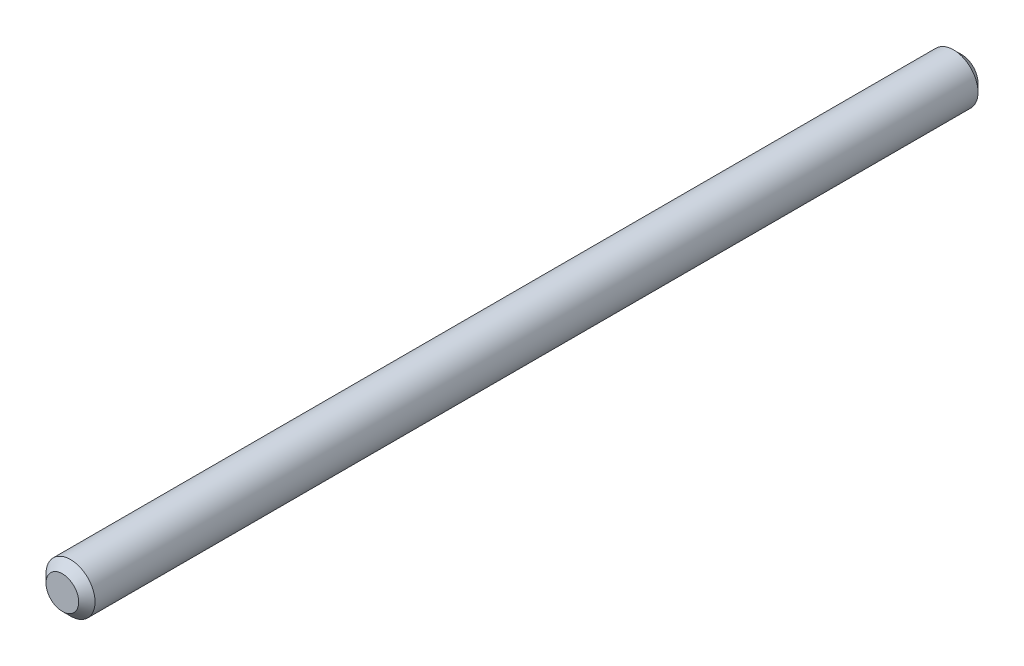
ISO-10303-21;
HEADER;
FILE_DESCRIPTION(('STEP AP214'),'2;1');
FILE_NAME('part.step','',(''),(''),'','','');
FILE_SCHEMA(('AUTOMOTIVE_DESIGN { 1 0 10303 214 1 1 1 1 }'));
ENDSEC;
DATA;
#1=APPLICATION_CONTEXT('core data for automotive mechanical design processes');
#2=APPLICATION_PROTOCOL_DEFINITION('international standard','automotive_design',2000,#1);
#3=PRODUCT_CONTEXT('',#1,'mechanical');
#4=PRODUCT('Part','Part','',(#3));
#5=PRODUCT_RELATED_PRODUCT_CATEGORY('part','',(#4));
#6=PRODUCT_DEFINITION_FORMATION('','',#4);
#7=PRODUCT_DEFINITION_CONTEXT('part definition',#1,'design');
#8=PRODUCT_DEFINITION('design','',#6,#7);
#9=PRODUCT_DEFINITION_SHAPE('','',#8);
#10=(LENGTH_UNIT() NAMED_UNIT(*) SI_UNIT(.MILLI.,.METRE.));
#11=(NAMED_UNIT(*) PLANE_ANGLE_UNIT() SI_UNIT($,.RADIAN.));
#12=(NAMED_UNIT(*) SI_UNIT($,.STERADIAN.) SOLID_ANGLE_UNIT());
#13=UNCERTAINTY_MEASURE_WITH_UNIT(LENGTH_MEASURE(1.E-05),#10,'distance_accuracy_value','');
#14=(GEOMETRIC_REPRESENTATION_CONTEXT(3) GLOBAL_UNCERTAINTY_ASSIGNED_CONTEXT((#13)) GLOBAL_UNIT_ASSIGNED_CONTEXT((#10,
#11,#12)) REPRESENTATION_CONTEXT('',''));
#15=CARTESIAN_POINT('',(0.,0.,0.));
#16=DIRECTION('',(0.,0.,1.));
#17=DIRECTION('',(1.,0.,0.));
#18=AXIS2_PLACEMENT_3D('',#15,#16,#17);
#19=CARTESIAN_POINT('',(0.,0.,55.));
#20=DIRECTION('',(0.,0.,-1.));
#21=DIRECTION('',(-1.,0.,0.));
#22=AXIS2_PLACEMENT_3D('',#19,#20,#21);
#23=CYLINDRICAL_SURFACE('',#22,1.5);
#24=CARTESIAN_POINT('',(0.,0.,0.499999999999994));
#25=DIRECTION('',(0.,0.,1.));
#26=DIRECTION('',(1.,0.,0.));
#27=AXIS2_PLACEMENT_3D('',#24,#25,#26);
#28=CIRCLE('',#27,1.5);
#29=CARTESIAN_POINT('',(1.5,0.,0.499999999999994));
#30=VERTEX_POINT('',#29);
#31=EDGE_CURVE('E34',#30,#30,#28,.T.);
#32=ORIENTED_EDGE('',*,*,#31,.T.);
#33=EDGE_LOOP('',(#32));
#34=FACE_BOUND('',#33,.T.);
#35=CARTESIAN_POINT('',(0.,0.,54.5));
#36=DIRECTION('',(0.,0.,1.));
#37=DIRECTION('',(1.,0.,0.));
#38=AXIS2_PLACEMENT_3D('',#35,#36,#37);
#39=CIRCLE('',#38,1.5);
#40=CARTESIAN_POINT('',(1.5,0.,54.5));
#41=VERTEX_POINT('',#40);
#42=EDGE_CURVE('E38',#41,#41,#39,.F.);
#43=ORIENTED_EDGE('',*,*,#42,.T.);
#44=EDGE_LOOP('',(#43));
#45=FACE_BOUND('',#44,.T.);
#46=ADVANCED_FACE('F24',(#34,#45),#23,.T.);
#47=CARTESIAN_POINT('',(0.,0.,55.));
#48=DIRECTION('',(0.,0.,1.));
#49=DIRECTION('',(1.,0.,0.));
#50=AXIS2_PLACEMENT_3D('',#47,#48,#49);
#51=PLANE('',#50);
#52=CARTESIAN_POINT('',(0.,0.,55.));
#53=DIRECTION('',(0.,0.,1.));
#54=DIRECTION('',(1.,0.,0.));
#55=AXIS2_PLACEMENT_3D('',#52,#53,#54);
#56=CIRCLE('',#55,1.);
#57=CARTESIAN_POINT('',(1.,0.,55.));
#58=VERTEX_POINT('',#57);
#59=EDGE_CURVE('E10',#58,#58,#56,.T.);
#60=ORIENTED_EDGE('',*,*,#59,.T.);
#61=EDGE_LOOP('',(#60));
#62=FACE_BOUND('',#61,.T.);
#63=ADVANCED_FACE('F57',(#62),#51,.T.);
#64=CARTESIAN_POINT('',(0.,0.,0.));
#65=DIRECTION('',(0.,0.,1.));
#66=DIRECTION('',(1.,0.,0.));
#67=AXIS2_PLACEMENT_3D('',#64,#65,#66);
#68=PLANE('',#67);
#69=CARTESIAN_POINT('',(0.,0.,0.));
#70=DIRECTION('',(0.,0.,1.));
#71=DIRECTION('',(1.,0.,0.));
#72=AXIS2_PLACEMENT_3D('',#69,#70,#71);
#73=CIRCLE('',#72,1.);
#74=CARTESIAN_POINT('',(1.,0.,0.));
#75=VERTEX_POINT('',#74);
#76=EDGE_CURVE('E30',#75,#75,#73,.F.);
#77=ORIENTED_EDGE('',*,*,#76,.T.);
#78=EDGE_LOOP('',(#77));
#79=FACE_BOUND('',#78,.T.);
#80=ADVANCED_FACE('F53',(#79),#68,.F.);
#81=CARTESIAN_POINT('',(0.,0.,0.499999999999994));
#82=DIRECTION('',(0.,0.,1.));
#83=DIRECTION('',(1.,0.,0.));
#84=AXIS2_PLACEMENT_3D('',#81,#82,#83);
#85=CONICAL_SURFACE('',#84,1.5,0.785398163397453);
#86=ORIENTED_EDGE('',*,*,#76,.F.);
#87=EDGE_LOOP('',(#86));
#88=FACE_BOUND('',#87,.T.);
#89=ORIENTED_EDGE('',*,*,#31,.F.);
#90=EDGE_LOOP('',(#89));
#91=FACE_BOUND('',#90,.T.);
#92=ADVANCED_FACE('F48',(#88,#91),#85,.T.);
#93=CARTESIAN_POINT('',(0.,0.,55.));
#94=DIRECTION('',(0.,0.,-1.));
#95=DIRECTION('',(-1.,0.,0.));
#96=AXIS2_PLACEMENT_3D('',#93,#94,#95);
#97=CONICAL_SURFACE('',#96,1.,0.785398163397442);
#98=ORIENTED_EDGE('',*,*,#42,.F.);
#99=EDGE_LOOP('',(#98));
#100=FACE_BOUND('',#99,.T.);
#101=ORIENTED_EDGE('',*,*,#59,.F.);
#102=EDGE_LOOP('',(#101));
#103=FACE_BOUND('',#102,.T.);
#104=ADVANCED_FACE('F45',(#100,#103),#97,.T.);
#105=CLOSED_SHELL('',(#46,#63,#80,#92,#104));
#106=MANIFOLD_SOLID_BREP('B2',#105);
#107=ADVANCED_BREP_SHAPE_REPRESENTATION('',(#18,#106),#14);
#108=SHAPE_DEFINITION_REPRESENTATION(#9,#107);
ENDSEC;
END-ISO-10303-21;
